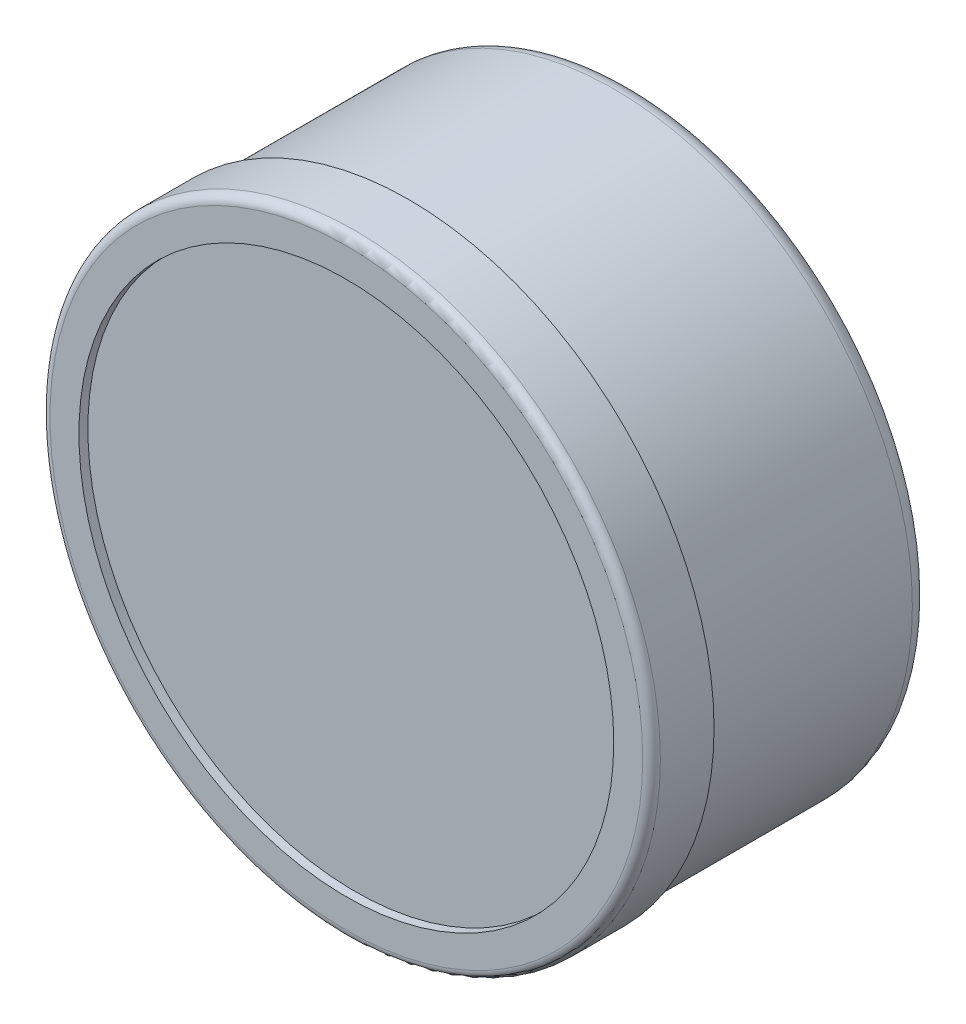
ISO-10303-21;
HEADER;
FILE_DESCRIPTION(('STEP AP214'),'2;1');
FILE_NAME('part.step','',(''),(''),'','','');
FILE_SCHEMA(('AUTOMOTIVE_DESIGN { 1 0 10303 214 1 1 1 1 }'));
ENDSEC;
DATA;
#1=APPLICATION_CONTEXT('core data for automotive mechanical design processes');
#2=APPLICATION_PROTOCOL_DEFINITION('international standard','automotive_design',2000,#1);
#3=PRODUCT_CONTEXT('',#1,'mechanical');
#4=PRODUCT('Part','Part','',(#3));
#5=PRODUCT_RELATED_PRODUCT_CATEGORY('part','',(#4));
#6=PRODUCT_DEFINITION_FORMATION('','',#4);
#7=PRODUCT_DEFINITION_CONTEXT('part definition',#1,'design');
#8=PRODUCT_DEFINITION('design','',#6,#7);
#9=PRODUCT_DEFINITION_SHAPE('','',#8);
#10=(LENGTH_UNIT() NAMED_UNIT(*) SI_UNIT(.MILLI.,.METRE.));
#11=(NAMED_UNIT(*) PLANE_ANGLE_UNIT() SI_UNIT($,.RADIAN.));
#12=(NAMED_UNIT(*) SI_UNIT($,.STERADIAN.) SOLID_ANGLE_UNIT());
#13=UNCERTAINTY_MEASURE_WITH_UNIT(LENGTH_MEASURE(1.E-05),#10,'distance_accuracy_value','');
#14=(GEOMETRIC_REPRESENTATION_CONTEXT(3) GLOBAL_UNCERTAINTY_ASSIGNED_CONTEXT((#13)) GLOBAL_UNIT_ASSIGNED_CONTEXT((#10,
#11,#12)) REPRESENTATION_CONTEXT('',''));
#15=CARTESIAN_POINT('',(0.,0.,0.));
#16=DIRECTION('',(0.,0.,1.));
#17=DIRECTION('',(1.,0.,0.));
#18=AXIS2_PLACEMENT_3D('',#15,#16,#17);
#19=CARTESIAN_POINT('',(0.,0.,6.00000001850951));
#20=DIRECTION('',(0.,0.,1.));
#21=DIRECTION('',(1.,0.,0.));
#22=AXIS2_PLACEMENT_3D('',#19,#20,#21);
#23=TOROIDAL_SURFACE('',#22,33.2501924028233,1.);
#24=CARTESIAN_POINT('',(0.,0.,6.01961553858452));
#25=DIRECTION('',(0.,0.,1.));
#26=DIRECTION('',(1.,0.,0.));
#27=AXIS2_PLACEMENT_3D('',#24,#25,#26);
#28=CIRCLE('',#27,34.25);
#29=CARTESIAN_POINT('',(34.25,0.,6.01961553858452));
#30=VERTEX_POINT('',#29);
#31=EDGE_CURVE('E8',#30,#30,#28,.T.);
#32=ORIENTED_EDGE('',*,*,#31,.T.);
#33=EDGE_LOOP('',(#32));
#34=FACE_BOUND('',#33,.T.);
#35=CARTESIAN_POINT('',(0.,0.,7.));
#36=DIRECTION('',(0.,0.,1.));
#37=DIRECTION('',(1.,0.,0.));
#38=AXIS2_PLACEMENT_3D('',#35,#36,#37);
#39=CIRCLE('',#38,33.25);
#40=CARTESIAN_POINT('',(33.25,0.,7.));
#41=VERTEX_POINT('',#40);
#42=EDGE_CURVE('E34',#41,#41,#39,.T.);
#43=ORIENTED_EDGE('',*,*,#42,.F.);
#44=EDGE_LOOP('',(#43));
#45=FACE_BOUND('',#44,.T.);
#46=ADVANCED_FACE('F12',(#34,#45),#23,.T.);
#47=CARTESIAN_POINT('',(0.,0.,16.714396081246));
#48=DIRECTION('',(0.,0.,1.));
#49=DIRECTION('',(1.,0.,0.));
#50=AXIS2_PLACEMENT_3D('',#47,#48,#49);
#51=CYLINDRICAL_SURFACE('',#50,34.25);
#52=ORIENTED_EDGE('',*,*,#31,.F.);
#53=EDGE_LOOP('',(#52));
#54=FACE_BOUND('',#53,.T.);
#55=CARTESIAN_POINT('',(0.,0.,0.));
#56=DIRECTION('',(0.,0.,1.));
#57=DIRECTION('',(1.,0.,0.));
#58=AXIS2_PLACEMENT_3D('',#55,#56,#57);
#59=CIRCLE('',#58,34.25);
#60=CARTESIAN_POINT('',(34.25,0.,0.));
#61=VERTEX_POINT('',#60);
#62=EDGE_CURVE('E18',#61,#61,#59,.T.);
#63=ORIENTED_EDGE('',*,*,#62,.T.);
#64=EDGE_LOOP('',(#63));
#65=FACE_BOUND('',#64,.T.);
#66=ADVANCED_FACE('F55',(#54,#65),#51,.T.);
#67=CARTESIAN_POINT('',(0.,-34.25,0.));
#68=DIRECTION('',(0.,0.,-1.));
#69=DIRECTION('',(-1.,0.,0.));
#70=AXIS2_PLACEMENT_3D('',#67,#68,#69);
#71=PLANE('',#70);
#72=CARTESIAN_POINT('',(0.,0.,0.));
#73=DIRECTION('',(0.,0.,1.));
#74=DIRECTION('',(1.,0.,0.));
#75=AXIS2_PLACEMENT_3D('',#72,#73,#74);
#76=CIRCLE('',#75,33.5);
#77=CARTESIAN_POINT('',(33.5,0.,0.));
#78=VERTEX_POINT('',#77);
#79=EDGE_CURVE('E22',#78,#78,#76,.T.);
#80=ORIENTED_EDGE('',*,*,#79,.T.);
#81=EDGE_LOOP('',(#80));
#82=FACE_BOUND('',#81,.T.);
#83=ORIENTED_EDGE('',*,*,#62,.F.);
#84=EDGE_LOOP('',(#83));
#85=FACE_BOUND('',#84,.T.);
#86=ADVANCED_FACE('F61',(#82,#85),#71,.T.);
#87=CARTESIAN_POINT('',(0.,0.,16.714396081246));
#88=DIRECTION('',(0.,0.,1.));
#89=DIRECTION('',(1.,0.,0.));
#90=AXIS2_PLACEMENT_3D('',#87,#88,#89);
#91=CYLINDRICAL_SURFACE('',#90,33.5);
#92=CARTESIAN_POINT('',(0.,0.,-23.));
#93=DIRECTION('',(0.,0.,1.));
#94=DIRECTION('',(1.,0.,0.));
#95=AXIS2_PLACEMENT_3D('',#92,#93,#94);
#96=CIRCLE('',#95,33.5);
#97=CARTESIAN_POINT('',(33.5,0.,-23.));
#98=VERTEX_POINT('',#97);
#99=EDGE_CURVE('E26',#98,#98,#96,.T.);
#100=ORIENTED_EDGE('',*,*,#99,.T.);
#101=EDGE_LOOP('',(#100));
#102=FACE_BOUND('',#101,.T.);
#103=ORIENTED_EDGE('',*,*,#79,.F.);
#104=EDGE_LOOP('',(#103));
#105=FACE_BOUND('',#104,.T.);
#106=ADVANCED_FACE('F67',(#102,#105),#91,.T.);
#107=CARTESIAN_POINT('',(0.,0.,-23.));
#108=DIRECTION('',(0.,0.,1.));
#109=DIRECTION('',(1.,0.,0.));
#110=AXIS2_PLACEMENT_3D('',#107,#108,#109);
#111=TOROIDAL_SURFACE('',#110,31.5,1.99999999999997);
#112=CARTESIAN_POINT('',(0.,0.,-25.));
#113=DIRECTION('',(0.,0.,1.));
#114=DIRECTION('',(1.,0.,0.));
#115=AXIS2_PLACEMENT_3D('',#112,#113,#114);
#116=CIRCLE('',#115,31.5);
#117=CARTESIAN_POINT('',(31.5,0.,-25.));
#118=VERTEX_POINT('',#117);
#119=EDGE_CURVE('E31',#118,#118,#116,.T.);
#120=ORIENTED_EDGE('',*,*,#119,.T.);
#121=EDGE_LOOP('',(#120));
#122=FACE_BOUND('',#121,.T.);
#123=ORIENTED_EDGE('',*,*,#99,.F.);
#124=EDGE_LOOP('',(#123));
#125=FACE_BOUND('',#124,.T.);
#126=ADVANCED_FACE('F73',(#122,#125),#111,.T.);
#127=CARTESIAN_POINT('',(0.,0.,-25.));
#128=DIRECTION('',(0.,0.,1.));
#129=DIRECTION('',(1.,0.,0.));
#130=AXIS2_PLACEMENT_3D('',#127,#128,#129);
#131=PLANE('',#130);
#132=ORIENTED_EDGE('',*,*,#119,.F.);
#133=EDGE_LOOP('',(#132));
#134=FACE_BOUND('',#133,.T.);
#135=ADVANCED_FACE('F49',(#134),#131,.F.);
#136=CARTESIAN_POINT('',(0.,-33.25,7.));
#137=DIRECTION('',(0.,0.,-1.));
#138=DIRECTION('',(-1.,0.,0.));
#139=AXIS2_PLACEMENT_3D('',#136,#137,#138);
#140=PLANE('',#139);
#141=CARTESIAN_POINT('',(0.,0.,7.));
#142=DIRECTION('',(0.,0.,1.));
#143=DIRECTION('',(1.,0.,0.));
#144=AXIS2_PLACEMENT_3D('',#141,#142,#143);
#145=CIRCLE('',#144,30.);
#146=CARTESIAN_POINT('',(30.,0.,7.));
#147=VERTEX_POINT('',#146);
#148=EDGE_CURVE('E40',#147,#147,#145,.T.);
#149=ORIENTED_EDGE('',*,*,#148,.F.);
#150=EDGE_LOOP('',(#149));
#151=FACE_BOUND('',#150,.T.);
#152=ORIENTED_EDGE('',*,*,#42,.T.);
#153=EDGE_LOOP('',(#152));
#154=FACE_BOUND('',#153,.T.);
#155=ADVANCED_FACE('F46',(#151,#154),#140,.F.);
#156=CARTESIAN_POINT('',(0.,0.,6.));
#157=DIRECTION('',(0.,0.,1.));
#158=DIRECTION('',(1.,0.,0.));
#159=AXIS2_PLACEMENT_3D('',#156,#157,#158);
#160=CYLINDRICAL_SURFACE('',#159,30.);
#161=CARTESIAN_POINT('',(0.,0.,6.));
#162=DIRECTION('',(0.,0.,1.));
#163=DIRECTION('',(1.,0.,0.));
#164=AXIS2_PLACEMENT_3D('',#161,#162,#163);
#165=CIRCLE('',#164,30.);
#166=CARTESIAN_POINT('',(30.,0.,6.));
#167=VERTEX_POINT('',#166);
#168=EDGE_CURVE('E37',#167,#167,#165,.T.);
#169=ORIENTED_EDGE('',*,*,#168,.F.);
#170=EDGE_LOOP('',(#169));
#171=FACE_BOUND('',#170,.T.);
#172=ORIENTED_EDGE('',*,*,#148,.T.);
#173=EDGE_LOOP('',(#172));
#174=FACE_BOUND('',#173,.T.);
#175=ADVANCED_FACE('F44',(#171,#174),#160,.F.);
#176=CARTESIAN_POINT('',(0.,0.,6.));
#177=DIRECTION('',(0.,0.,1.));
#178=DIRECTION('',(1.,0.,0.));
#179=AXIS2_PLACEMENT_3D('',#176,#177,#178);
#180=PLANE('',#179);
#181=ORIENTED_EDGE('',*,*,#168,.T.);
#182=EDGE_LOOP('',(#181));
#183=FACE_BOUND('',#182,.T.);
#184=ADVANCED_FACE('F51',(#183),#180,.T.);
#185=CLOSED_SHELL('',(#46,#66,#86,#106,#126,#135,#155,#175,#184));
#186=MANIFOLD_SOLID_BREP('B1',#185);
#187=ADVANCED_BREP_SHAPE_REPRESENTATION('',(#18,#186),#14);
#188=SHAPE_DEFINITION_REPRESENTATION(#9,#187);
ENDSEC;
END-ISO-10303-21;
